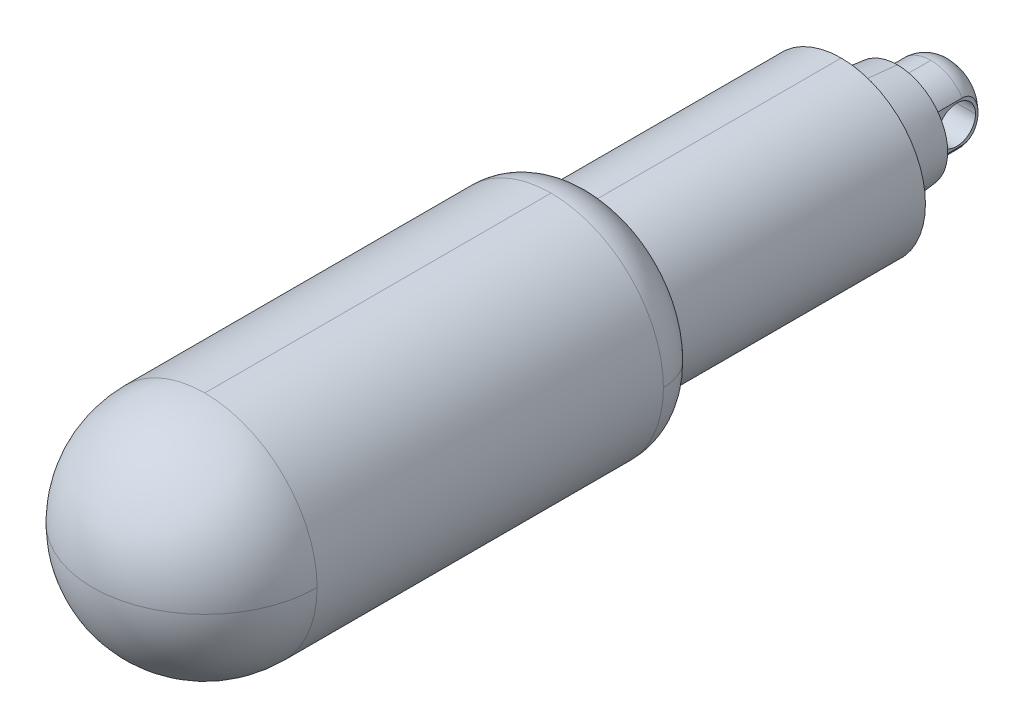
ISO-10303-21;
HEADER;
FILE_DESCRIPTION(('STEP AP214'),'2;1');
FILE_NAME('part.step','',(''),(''),'','','');
FILE_SCHEMA(('AUTOMOTIVE_DESIGN { 1 0 10303 214 1 1 1 1 }'));
ENDSEC;
DATA;
#1=APPLICATION_CONTEXT('core data for automotive mechanical design processes');
#2=APPLICATION_PROTOCOL_DEFINITION('international standard','automotive_design',2000,#1);
#3=PRODUCT_CONTEXT('',#1,'mechanical');
#4=PRODUCT('Part','Part','',(#3));
#5=PRODUCT_RELATED_PRODUCT_CATEGORY('part','',(#4));
#6=PRODUCT_DEFINITION_FORMATION('','',#4);
#7=PRODUCT_DEFINITION_CONTEXT('part definition',#1,'design');
#8=PRODUCT_DEFINITION('design','',#6,#7);
#9=PRODUCT_DEFINITION_SHAPE('','',#8);
#10=(LENGTH_UNIT() NAMED_UNIT(*) SI_UNIT(.MILLI.,.METRE.));
#11=(NAMED_UNIT(*) PLANE_ANGLE_UNIT() SI_UNIT($,.RADIAN.));
#12=(NAMED_UNIT(*) SI_UNIT($,.STERADIAN.) SOLID_ANGLE_UNIT());
#13=UNCERTAINTY_MEASURE_WITH_UNIT(LENGTH_MEASURE(1.E-05),#10,'distance_accuracy_value','');
#14=(GEOMETRIC_REPRESENTATION_CONTEXT(3) GLOBAL_UNCERTAINTY_ASSIGNED_CONTEXT((#13)) GLOBAL_UNIT_ASSIGNED_CONTEXT((#10,
#11,#12)) REPRESENTATION_CONTEXT('',''));
#15=CARTESIAN_POINT('',(0.,0.,0.));
#16=DIRECTION('',(0.,0.,1.));
#17=DIRECTION('',(1.,0.,0.));
#18=AXIS2_PLACEMENT_3D('',#15,#16,#17);
#19=CARTESIAN_POINT('',(0.,-0.75,-3.0833333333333));
#20=DIRECTION('',(0.,0.,-1.));
#21=DIRECTION('',(0.,-1.,0.));
#22=AXIS2_PLACEMENT_3D('',#19,#20,#21);
#23=PLANE('',#22);
#24=CARTESIAN_POINT('',(0.,0.,-3.0833333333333));
#25=DIRECTION('',(0.,0.,1.));
#26=DIRECTION('',(-1.,0.,0.));
#27=AXIS2_PLACEMENT_3D('',#24,#25,#26);
#28=CIRCLE('',#27,1.5);
#29=CARTESIAN_POINT('',(-1.5,0.,-3.0833333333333));
#30=VERTEX_POINT('',#29);
#31=CARTESIAN_POINT('',(0.,-1.5,-3.0833333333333));
#32=VERTEX_POINT('',#31);
#33=EDGE_CURVE('E134',#30,#32,#28,.T.);
#34=ORIENTED_EDGE('',*,*,#33,.F.);
#35=CARTESIAN_POINT('',(0.,0.,-3.0833333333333));
#36=DIRECTION('',(0.,0.,1.));
#37=DIRECTION('',(1.,0.,0.));
#38=AXIS2_PLACEMENT_3D('',#35,#36,#37);
#39=CIRCLE('',#38,1.5);
#40=CARTESIAN_POINT('',(1.5,0.,-3.0833333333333));
#41=VERTEX_POINT('',#40);
#42=EDGE_CURVE('E138',#41,#30,#39,.T.);
#43=ORIENTED_EDGE('',*,*,#42,.F.);
#44=CARTESIAN_POINT('',(0.,0.,-3.0833333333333));
#45=DIRECTION('',(0.,0.,1.));
#46=DIRECTION('',(0.,-1.,0.));
#47=AXIS2_PLACEMENT_3D('',#44,#45,#46);
#48=CIRCLE('',#47,1.5);
#49=EDGE_CURVE('E131',#32,#41,#48,.T.);
#50=ORIENTED_EDGE('',*,*,#49,.F.);
#51=EDGE_LOOP('',(#34,#43,#50));
#52=FACE_BOUND('',#51,.T.);
#53=ADVANCED_FACE('F14',(#52),#23,.T.);
#54=CARTESIAN_POINT('',(-12.,0.,0.));
#55=DIRECTION('',(-1.,0.,0.));
#56=DIRECTION('',(0.,-1.,0.));
#57=AXIS2_PLACEMENT_3D('',#54,#55,#56);
#58=CYLINDRICAL_SURFACE('',#57,2.);
#59=CARTESIAN_POINT('',(3.35,0.,0.));
#60=DIRECTION('',(-1.,0.,0.));
#61=DIRECTION('',(0.,-1.,0.));
#62=AXIS2_PLACEMENT_3D('',#59,#60,#61);
#63=CIRCLE('',#62,2.);
#64=CARTESIAN_POINT('',(3.35,0.,2.));
#65=VERTEX_POINT('',#64);
#66=CARTESIAN_POINT('',(3.35,0.,-2.));
#67=VERTEX_POINT('',#66);
#68=EDGE_CURVE('E201',#65,#67,#63,.F.);
#69=ORIENTED_EDGE('',*,*,#68,.T.);
#70=DIRECTION('',(-1.,0.,0.));
#71=VECTOR('',#70,1.);
#72=CARTESIAN_POINT('',(-12.,0.,-2.));
#73=LINE('',#72,#71);
#74=CARTESIAN_POINT('',(-3.35,0.,-2.));
#75=VERTEX_POINT('',#74);
#76=EDGE_CURVE('E112',#67,#75,#73,.T.);
#77=ORIENTED_EDGE('',*,*,#76,.T.);
#78=CARTESIAN_POINT('',(-3.35,0.,0.));
#79=DIRECTION('',(-1.,0.,0.));
#80=DIRECTION('',(0.,-1.,0.));
#81=AXIS2_PLACEMENT_3D('',#78,#79,#80);
#82=CIRCLE('',#81,2.);
#83=CARTESIAN_POINT('',(-3.35,0.,2.));
#84=VERTEX_POINT('',#83);
#85=EDGE_CURVE('E213',#75,#84,#82,.T.);
#86=ORIENTED_EDGE('',*,*,#85,.T.);
#87=DIRECTION('',(-1.,0.,0.));
#88=VECTOR('',#87,1.);
#89=CARTESIAN_POINT('',(-12.,0.,2.));
#90=LINE('',#89,#88);
#91=EDGE_CURVE('E150',#84,#65,#90,.F.);
#92=ORIENTED_EDGE('',*,*,#91,.T.);
#93=EDGE_LOOP('',(#69,#77,#86,#92));
#94=FACE_BOUND('',#93,.T.);
#95=ADVANCED_FACE('F411',(#94),#58,.F.);
#96=CARTESIAN_POINT('',(-12.,0.,0.));
#97=DIRECTION('',(-1.,0.,0.));
#98=DIRECTION('',(0.,-1.,0.));
#99=AXIS2_PLACEMENT_3D('',#96,#97,#98);
#100=CYLINDRICAL_SURFACE('',#99,2.);
#101=CARTESIAN_POINT('',(-3.35,0.,0.));
#102=DIRECTION('',(-1.,0.,0.));
#103=DIRECTION('',(0.,-1.,0.));
#104=AXIS2_PLACEMENT_3D('',#101,#102,#103);
#105=CIRCLE('',#104,2.);
#106=EDGE_CURVE('E318',#84,#75,#105,.T.);
#107=ORIENTED_EDGE('',*,*,#106,.T.);
#108=ORIENTED_EDGE('',*,*,#76,.F.);
#109=CARTESIAN_POINT('',(3.35,0.,0.));
#110=DIRECTION('',(-1.,0.,0.));
#111=DIRECTION('',(0.,-1.,0.));
#112=AXIS2_PLACEMENT_3D('',#109,#110,#111);
#113=CIRCLE('',#112,2.);
#114=EDGE_CURVE('E18',#67,#65,#113,.F.);
#115=ORIENTED_EDGE('',*,*,#114,.T.);
#116=ORIENTED_EDGE('',*,*,#91,.F.);
#117=EDGE_LOOP('',(#107,#108,#115,#116));
#118=FACE_BOUND('',#117,.T.);
#119=ADVANCED_FACE('F171',(#118),#100,.F.);
#120=CARTESIAN_POINT('',(1.5,0.,-0.583333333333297));
#121=DIRECTION('',(0.,1.,0.));
#122=DIRECTION('',(1.,0.,0.));
#123=AXIS2_PLACEMENT_3D('',#120,#121,#122);
#124=CIRCLE('',#123,2.5);
#125=TRIMMED_CURVE('',#124,(PARAMETER_VALUE(-2.21429743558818)),
(PARAMETER_VALUE(2.21429743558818)),.T.,.PARAMETER.);
#126=CARTESIAN_POINT('',(0.,0.,-0.583333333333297));
#127=DIRECTION('',(0.,0.,1.));
#128=AXIS1_PLACEMENT('',#126,#127);
#129=SURFACE_OF_REVOLUTION('',#125,#128);
#130=ORIENTED_EDGE('',*,*,#33,.T.);
#131=ORIENTED_EDGE('',*,*,#49,.T.);
#132=CARTESIAN_POINT('',(1.5,0.,-0.583333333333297));
#133=DIRECTION('',(0.,1.,0.));
#134=DIRECTION('',(1.,0.,0.));
#135=AXIS2_PLACEMENT_3D('',#132,#133,#134);
#136=CIRCLE('',#135,2.5);
#137=CARTESIAN_POINT('',(3.35,0.,-2.2648505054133));
#138=VERTEX_POINT('',#137);
#139=EDGE_CURVE('E143',#138,#41,#136,.T.);
#140=ORIENTED_EDGE('',*,*,#139,.F.);
#141=CARTESIAN_POINT('',(3.35,0.,-2.2648505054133));
#142=CARTESIAN_POINT('',(3.35,-0.0754425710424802,-2.26483182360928));
#143=CARTESIAN_POINT('',(3.35,-0.15089491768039,-2.26204566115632));
#144=CARTESIAN_POINT('',(3.35,-0.301463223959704,-2.25079679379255));
#145=CARTESIAN_POINT('',(3.35,-0.376578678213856,-2.24232735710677));
#146=CARTESIAN_POINT('',(3.35,-0.52665281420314,-2.21946055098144));
#147=CARTESIAN_POINT('',(3.35,-0.601603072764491,-2.20500707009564));
#148=CARTESIAN_POINT('',(3.35,-0.750000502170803,-2.16992943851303));
#149=CARTESIAN_POINT('',(3.35,-0.823448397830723,-2.14930834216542));
#150=CARTESIAN_POINT('',(3.35,-1.00988032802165,-2.08785206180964));
#151=CARTESIAN_POINT('',(3.35000000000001,-1.12134084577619,-2.04220953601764));
#152=CARTESIAN_POINT('',(3.34999999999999,-1.33522725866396,-1.93376510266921));
#153=CARTESIAN_POINT('',(3.34999999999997,-1.43768585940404,-1.87102902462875));
#154=CARTESIAN_POINT('',(3.35000000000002,-1.60964311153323,-1.74246365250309));
#155=CARTESIAN_POINT('',(3.35000000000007,-1.68158732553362,-1.6799220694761));
#156=CARTESIAN_POINT('',(3.34999999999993,-1.81436566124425,-1.54384878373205));
#157=CARTESIAN_POINT('',(3.34999999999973,-1.87519707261,-1.47031440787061));
#158=CARTESIAN_POINT('',(3.3499999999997,-1.98313209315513,-1.31268560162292));
#159=CARTESIAN_POINT('',(3.34999999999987,-2.03011755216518,-1.2285085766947));
#160=CARTESIAN_POINT('',(3.35000000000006,-2.08749421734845,-1.09673181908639));
#161=CARTESIAN_POINT('',(3.35000000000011,-2.10443360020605,-1.05189952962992));
#162=CARTESIAN_POINT('',(3.34999999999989,-2.13369721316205,-0.960761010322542));
#163=CARTESIAN_POINT('',(3.34999999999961,-2.14602396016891,-0.914455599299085));
#164=CARTESIAN_POINT('',(3.34999999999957,-2.16580487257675,-0.820926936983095));
#165=CARTESIAN_POINT('',(3.34999999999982,-2.17327015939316,-0.773706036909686));
#166=CARTESIAN_POINT('',(3.35000000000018,-2.18324910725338,-0.678770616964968));
#167=CARTESIAN_POINT('',(3.35000000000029,-2.18576541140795,-0.631056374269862));
#168=CARTESIAN_POINT('',(3.35,-2.18574929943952,-0.583333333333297));
#169=B_SPLINE_CURVE_WITH_KNOTS('',3,(#141,#142,#143,#144,#145,#146,#147,#148,#149,#150,#151,
#152,#153,#154,#155,#156,#157,#158,#159,#160,#161,#162,#163,#164,#165,#166,#167,#168),
.UNSPECIFIED.,.F.,.F.,(4,2,2,2,2,2,2,2,2,2,2,2,2,4),(0.,0.226291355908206,0.452851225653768,
0.681585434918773,0.910206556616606,1.27014773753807,1.62872186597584,1.91357555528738,
2.19849862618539,2.48578692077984,2.62935968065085,2.77285398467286,2.91601885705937,
3.05910724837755),.UNSPECIFIED.);
#170=CARTESIAN_POINT('',(3.35,-2.18574929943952,-0.583333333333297));
#171=VERTEX_POINT('',#170);
#172=EDGE_CURVE('E312',#138,#171,#169,.T.);
#173=ORIENTED_EDGE('',*,*,#172,.T.);
#174=CARTESIAN_POINT('',(0.,0.,-0.583333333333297));
#175=DIRECTION('',(0.,0.,-1.));
#176=DIRECTION('',(1.,0.,0.));
#177=AXIS2_PLACEMENT_3D('',#174,#175,#176);
#178=CIRCLE('',#177,4.);
#179=CARTESIAN_POINT('',(0.,-4.,-0.583333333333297));
#180=VERTEX_POINT('',#179);
#181=EDGE_CURVE('E195',#180,#171,#178,.F.);
#182=ORIENTED_EDGE('',*,*,#181,.F.);
#183=CARTESIAN_POINT('',(0.,0.,-0.583333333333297));
#184=DIRECTION('',(0.,0.,-1.));
#185=DIRECTION('',(1.,0.,0.));
#186=AXIS2_PLACEMENT_3D('',#183,#184,#185);
#187=CIRCLE('',#186,4.);
#188=CARTESIAN_POINT('',(-3.35,-2.18574929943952,-0.583333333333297));
#189=VERTEX_POINT('',#188);
#190=EDGE_CURVE('E119',#189,#180,#187,.F.);
#191=ORIENTED_EDGE('',*,*,#190,.F.);
#192=CARTESIAN_POINT('',(-3.35,-2.18574929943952,-0.583333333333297));
#193=CARTESIAN_POINT('',(-3.35,-2.18576028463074,-0.626622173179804));
#194=CARTESIAN_POINT('',(-3.35,-2.18369202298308,-0.669905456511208));
#195=CARTESIAN_POINT('',(-3.35,-2.17548130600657,-0.75606406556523));
#196=CARTESIAN_POINT('',(-3.35,-2.16934076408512,-0.798939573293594));
#197=CARTESIAN_POINT('',(-3.35,-2.15311794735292,-0.883674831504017));
#198=CARTESIAN_POINT('',(-3.35,-2.14305929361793,-0.92553910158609));
#199=CARTESIAN_POINT('',(-3.35,-2.11916399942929,-1.00816362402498));
#200=CARTESIAN_POINT('',(-3.35,-2.10532713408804,-1.04892381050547));
#201=CARTESIAN_POINT('',(-3.35,-2.05847222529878,-1.16896268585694));
#202=CARTESIAN_POINT('',(-3.35,-2.02006977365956,-1.24620337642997));
#203=CARTESIAN_POINT('',(-3.35,-1.93091834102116,-1.39316793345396));
#204=CARTESIAN_POINT('',(-3.35,-1.88015621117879,-1.46288367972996));
#205=CARTESIAN_POINT('',(-3.35,-1.76840219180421,-1.59379734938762));
#206=CARTESIAN_POINT('',(-3.35,-1.70738594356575,-1.6549743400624));
#207=CARTESIAN_POINT('',(-3.35,-1.57742304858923,-1.76811368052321));
#208=CARTESIAN_POINT('',(-3.35,-1.50847575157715,-1.82007527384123));
#209=CARTESIAN_POINT('',(-3.35,-1.32954562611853,-1.93786242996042));
#210=CARTESIAN_POINT('',(-3.35,-1.21590781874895,-1.99814822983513));
#211=CARTESIAN_POINT('',(-3.35,-0.980125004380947,-2.09968218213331));
#212=CARTESIAN_POINT('',(-3.34999999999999,-0.857950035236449,-2.14085896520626));
#213=CARTESIAN_POINT('',(-3.35,-0.673529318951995,-2.1887320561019));
#214=CARTESIAN_POINT('',(-3.35000000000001,-0.612952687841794,-2.20224909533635));
#215=CARTESIAN_POINT('',(-3.34999999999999,-0.491029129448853,-2.2252901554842));
#216=CARTESIAN_POINT('',(-3.34999999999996,-0.429682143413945,-2.2348138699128));
#217=CARTESIAN_POINT('',(-3.35000000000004,-0.307044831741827,-2.24991444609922));
#218=CARTESIAN_POINT('',(-3.35000000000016,-0.245758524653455,-2.25552442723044));
#219=CARTESIAN_POINT('',(-3.34999999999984,-0.122980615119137,-2.26298753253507));
#220=CARTESIAN_POINT('',(-3.34999999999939,-0.0614891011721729,-2.26484210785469));
#221=CARTESIAN_POINT('',(-3.3499999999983,0.,-2.2648505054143));
#222=B_SPLINE_CURVE_WITH_KNOTS('',3,(#192,#193,#194,#195,#196,#197,#198,#199,#200,#201,#202,
#203,#204,#205,#206,#207,#208,#209,#210,#211,#212,#213,#214,#215,#216,#217,#218,#219,#220,#221),
.UNSPECIFIED.,.F.,.F.,(4,2,2,2,2,2,2,2,2,2,2,2,2,2,4),(0.,0.129807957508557,0.259554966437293,
0.388531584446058,0.517515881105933,0.774870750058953,1.03250061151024,1.29075135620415,
1.54902329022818,1.93284731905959,2.31809356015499,2.50418781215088,2.69029634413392,
2.87481020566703,3.05925275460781),.UNSPECIFIED.);
#223=CARTESIAN_POINT('',(-3.35,0.,-2.2648505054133));
#224=VERTEX_POINT('',#223);
#225=EDGE_CURVE('E263',#189,#224,#222,.T.);
#226=ORIENTED_EDGE('',*,*,#225,.T.);
#227=CARTESIAN_POINT('',(-1.5,0.,-0.583333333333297));
#228=DIRECTION('',(0.,-1.,0.));
#229=DIRECTION('',(-1.,0.,0.));
#230=AXIS2_PLACEMENT_3D('',#227,#228,#229);
#231=CIRCLE('',#230,2.5);
#232=EDGE_CURVE('E149',#30,#224,#231,.F.);
#233=ORIENTED_EDGE('',*,*,#232,.F.);
#234=EDGE_LOOP('',(#130,#131,#140,#173,#182,#191,#226,#233));
#235=FACE_BOUND('',#234,.T.);
#236=ADVANCED_FACE('F147',(#235),#129,.F.);
#237=CARTESIAN_POINT('',(1.5,0.,-0.583333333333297));
#238=DIRECTION('',(0.,1.,0.));
#239=DIRECTION('',(1.,0.,0.));
#240=AXIS2_PLACEMENT_3D('',#237,#238,#239);
#241=CIRCLE('',#240,2.5);
#242=TRIMMED_CURVE('',#241,(PARAMETER_VALUE(-2.21429743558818)),
(PARAMETER_VALUE(2.21429743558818)),.T.,.PARAMETER.);
#243=CARTESIAN_POINT('',(0.,0.,-0.583333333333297));
#244=DIRECTION('',(0.,0.,1.));
#245=AXIS1_PLACEMENT('',#243,#244);
#246=SURFACE_OF_REVOLUTION('',#242,#245);
#247=CARTESIAN_POINT('',(0.,0.,-0.583333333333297));
#248=DIRECTION('',(0.,0.,-1.));
#249=DIRECTION('',(1.,0.,0.));
#250=AXIS2_PLACEMENT_3D('',#247,#248,#249);
#251=CIRCLE('',#250,4.);
#252=CARTESIAN_POINT('',(3.3500000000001,2.18574929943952,-0.583333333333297));
#253=VERTEX_POINT('',#252);
#254=CARTESIAN_POINT('',(0.,4.,-0.583333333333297));
#255=VERTEX_POINT('',#254);
#256=EDGE_CURVE('E188',#253,#255,#251,.F.);
#257=ORIENTED_EDGE('',*,*,#256,.F.);
#258=CARTESIAN_POINT('',(3.35,2.18574929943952,-0.583333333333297));
#259=CARTESIAN_POINT('',(3.35,2.18576028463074,-0.626622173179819));
#260=CARTESIAN_POINT('',(3.35,2.18369202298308,-0.669905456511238));
#261=CARTESIAN_POINT('',(3.35,2.17548130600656,-0.756064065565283));
#262=CARTESIAN_POINT('',(3.35,2.16934076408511,-0.798939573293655));
#263=CARTESIAN_POINT('',(3.35,2.1531179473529,-0.883674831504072));
#264=CARTESIAN_POINT('',(3.35,2.14305929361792,-0.925539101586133));
#265=CARTESIAN_POINT('',(3.35,2.11916399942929,-1.008163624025));
#266=CARTESIAN_POINT('',(3.35,2.10532713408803,-1.04892381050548));
#267=CARTESIAN_POINT('',(3.35,2.05847222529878,-1.16896268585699));
#268=CARTESIAN_POINT('',(3.35,2.0200697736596,-1.24620337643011));
#269=CARTESIAN_POINT('',(3.35,1.93091834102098,-1.39316793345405));
#270=CARTESIAN_POINT('',(3.35,1.88015621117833,-1.46288367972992));
#271=CARTESIAN_POINT('',(3.35,1.7684021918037,-1.59379734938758));
#272=CARTESIAN_POINT('',(3.35,1.70738594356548,-1.65497434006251));
#273=CARTESIAN_POINT('',(3.35,1.57742304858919,-1.76811368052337));
#274=CARTESIAN_POINT('',(3.35,1.50847575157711,-1.8200752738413));
#275=CARTESIAN_POINT('',(3.35,1.3295456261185,-1.93786242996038));
#276=CARTESIAN_POINT('',(3.35,1.21590781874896,-1.99814822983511));
#277=CARTESIAN_POINT('',(3.35,0.980125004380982,-2.09968218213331));
#278=CARTESIAN_POINT('',(3.34999999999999,0.857950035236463,-2.14085896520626));
#279=CARTESIAN_POINT('',(3.35,0.673529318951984,-2.1887320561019));
#280=CARTESIAN_POINT('',(3.35000000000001,0.612952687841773,-2.20224909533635));
#281=CARTESIAN_POINT('',(3.34999999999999,0.491029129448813,-2.22529015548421));
#282=CARTESIAN_POINT('',(3.34999999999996,0.429682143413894,-2.23481386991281));
#283=CARTESIAN_POINT('',(3.35000000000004,0.307044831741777,-2.24991444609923));
#284=CARTESIAN_POINT('',(3.35000000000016,0.245758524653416,-2.25552442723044));
#285=CARTESIAN_POINT('',(3.34999999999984,0.122980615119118,-2.26298753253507));
#286=CARTESIAN_POINT('',(3.34999999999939,0.0614891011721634,-2.26484210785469));
#287=CARTESIAN_POINT('',(3.3499999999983,0.,-2.2648505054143));
#288=B_SPLINE_CURVE_WITH_KNOTS('',3,(#258,#259,#260,#261,#262,#263,#264,#265,#266,#267,#268,
#269,#270,#271,#272,#273,#274,#275,#276,#277,#278,#279,#280,#281,#282,#283,#284,#285,#286,#287),
.UNSPECIFIED.,.F.,.F.,(4,2,2,2,2,2,2,2,2,2,2,2,2,2,4),(0.,0.129807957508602,0.259554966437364,
0.388531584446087,0.517515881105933,0.774870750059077,1.03250061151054,1.2907513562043,
1.54902329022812,1.93284731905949,2.31809356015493,2.50418781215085,2.69029634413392,
2.874810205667,3.05925275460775),.UNSPECIFIED.);
#289=EDGE_CURVE('E306',#253,#138,#288,.T.);
#290=ORIENTED_EDGE('',*,*,#289,.T.);
#291=ORIENTED_EDGE('',*,*,#139,.T.);
#292=ORIENTED_EDGE('',*,*,#42,.T.);
#293=ORIENTED_EDGE('',*,*,#232,.T.);
#294=CARTESIAN_POINT('',(-3.35,0.,-2.2648505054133));
#295=CARTESIAN_POINT('',(-3.35,0.0754425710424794,-2.26483182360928));
#296=CARTESIAN_POINT('',(-3.35,0.150894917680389,-2.26204566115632));
#297=CARTESIAN_POINT('',(-3.35,0.301463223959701,-2.25079679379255));
#298=CARTESIAN_POINT('',(-3.35,0.376578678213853,-2.24232735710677));
#299=CARTESIAN_POINT('',(-3.35,0.526652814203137,-2.21946055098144));
#300=CARTESIAN_POINT('',(-3.35,0.601603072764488,-2.20500707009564));
#301=CARTESIAN_POINT('',(-3.35,0.750000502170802,-2.16992943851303));
#302=CARTESIAN_POINT('',(-3.35,0.823448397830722,-2.14930834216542));
#303=CARTESIAN_POINT('',(-3.35,1.00988032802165,-2.08785206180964));
#304=CARTESIAN_POINT('',(-3.35000000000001,1.12134084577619,-2.04220953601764));
#305=CARTESIAN_POINT('',(-3.34999999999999,1.33522725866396,-1.9337651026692));
#306=CARTESIAN_POINT('',(-3.34999999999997,1.43768585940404,-1.87102902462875));
#307=CARTESIAN_POINT('',(-3.35000000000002,1.60964311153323,-1.74246365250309));
#308=CARTESIAN_POINT('',(-3.35000000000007,1.68158732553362,-1.6799220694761));
#309=CARTESIAN_POINT('',(-3.34999999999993,1.81436566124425,-1.54384878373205));
#310=CARTESIAN_POINT('',(-3.34999999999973,1.87519707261,-1.47031440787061));
#311=CARTESIAN_POINT('',(-3.34999999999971,1.98313209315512,-1.31268560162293));
#312=CARTESIAN_POINT('',(-3.34999999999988,2.03011755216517,-1.22850857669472));
#313=CARTESIAN_POINT('',(-3.35000000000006,2.08749421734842,-1.09673181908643));
#314=CARTESIAN_POINT('',(-3.35000000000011,2.10443360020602,-1.05189952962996));
#315=CARTESIAN_POINT('',(-3.34999999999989,2.13369721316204,-0.960761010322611));
#316=CARTESIAN_POINT('',(-3.34999999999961,2.14602396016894,-0.914455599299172));
#317=CARTESIAN_POINT('',(-3.34999999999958,2.16580487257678,-0.82092693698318));
#318=CARTESIAN_POINT('',(-3.34999999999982,2.17327015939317,-0.773706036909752));
#319=CARTESIAN_POINT('',(-3.35000000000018,2.18324910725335,-0.678770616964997));
#320=CARTESIAN_POINT('',(-3.35000000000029,2.18576541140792,-0.631056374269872));
#321=CARTESIAN_POINT('',(-3.35,2.18574929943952,-0.583333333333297));
#322=B_SPLINE_CURVE_WITH_KNOTS('',3,(#294,#295,#296,#297,#298,#299,#300,#301,#302,#303,#304,
#305,#306,#307,#308,#309,#310,#311,#312,#313,#314,#315,#316,#317,#318,#319,#320,#321),
.UNSPECIFIED.,.F.,.F.,(4,2,2,2,2,2,2,2,2,2,2,2,2,4),(0.,0.226291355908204,0.452851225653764,
0.681585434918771,0.910206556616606,1.27014773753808,1.62872186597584,1.91357555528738,
2.19849862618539,2.4857869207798,2.62935968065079,2.77285398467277,2.91601885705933,
3.05910724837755),.UNSPECIFIED.);
#323=CARTESIAN_POINT('',(-3.35,2.18574929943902,-0.583333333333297));
#324=VERTEX_POINT('',#323);
#325=EDGE_CURVE('E256',#224,#324,#322,.T.);
#326=ORIENTED_EDGE('',*,*,#325,.T.);
#327=CARTESIAN_POINT('',(0.,0.,-0.583333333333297));
#328=DIRECTION('',(0.,0.,-1.));
#329=DIRECTION('',(1.,0.,0.));
#330=AXIS2_PLACEMENT_3D('',#327,#328,#329);
#331=CIRCLE('',#330,4.);
#332=EDGE_CURVE('E210',#255,#324,#331,.F.);
#333=ORIENTED_EDGE('',*,*,#332,.F.);
#334=EDGE_LOOP('',(#257,#290,#291,#292,#293,#326,#333));
#335=FACE_BOUND('',#334,.T.);
#336=ADVANCED_FACE('F170',(#335),#246,.F.);
#337=CARTESIAN_POINT('',(0.,0.,1.2083333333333));
#338=DIRECTION('',(0.,0.,-1.));
#339=DIRECTION('',(1.,0.,0.));
#340=AXIS2_PLACEMENT_3D('',#337,#338,#339);
#341=CYLINDRICAL_SURFACE('',#340,4.);
#342=DIRECTION('',(0.,0.,1.));
#343=VECTOR('',#342,1.);
#344=CARTESIAN_POINT('',(-3.35,-2.18574929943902,3.));
#345=LINE('',#344,#343);
#346=CARTESIAN_POINT('',(-3.35,-2.18574929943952,3.));
#347=VERTEX_POINT('',#346);
#348=EDGE_CURVE('E269',#347,#189,#345,.F.);
#349=ORIENTED_EDGE('',*,*,#348,.T.);
#350=ORIENTED_EDGE('',*,*,#190,.T.);
#351=DIRECTION('',(0.,0.,-1.));
#352=VECTOR('',#351,1.);
#353=CARTESIAN_POINT('',(0.,-4.,1.2083333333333));
#354=LINE('',#353,#352);
#355=CARTESIAN_POINT('',(0.,-4.,3.));
#356=VERTEX_POINT('',#355);
#357=EDGE_CURVE('E183',#356,#180,#354,.T.);
#358=ORIENTED_EDGE('',*,*,#357,.F.);
#359=CARTESIAN_POINT('',(0.,0.,3.));
#360=DIRECTION('',(0.,0.,-1.));
#361=DIRECTION('',(1.,0.,0.));
#362=AXIS2_PLACEMENT_3D('',#359,#360,#361);
#363=CIRCLE('',#362,4.);
#364=EDGE_CURVE('E267',#347,#356,#363,.F.);
#365=ORIENTED_EDGE('',*,*,#364,.F.);
#366=EDGE_LOOP('',(#349,#350,#358,#365));
#367=FACE_BOUND('',#366,.T.);
#368=ADVANCED_FACE('F660',(#367),#341,.T.);
#369=CARTESIAN_POINT('',(0.,0.,1.2083333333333));
#370=DIRECTION('',(0.,0.,-1.));
#371=DIRECTION('',(1.,0.,0.));
#372=AXIS2_PLACEMENT_3D('',#369,#370,#371);
#373=CYLINDRICAL_SURFACE('',#372,4.);
#374=DIRECTION('',(0.,0.,-1.));
#375=VECTOR('',#374,1.);
#376=CARTESIAN_POINT('',(3.35,-2.18574929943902,-2.5833333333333));
#377=LINE('',#376,#375);
#378=CARTESIAN_POINT('',(3.35,-2.18574929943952,3.));
#379=VERTEX_POINT('',#378);
#380=EDGE_CURVE('E206',#171,#379,#377,.F.);
#381=ORIENTED_EDGE('',*,*,#380,.T.);
#382=CARTESIAN_POINT('',(0.,0.,3.));
#383=DIRECTION('',(0.,0.,-1.));
#384=DIRECTION('',(1.,0.,0.));
#385=AXIS2_PLACEMENT_3D('',#382,#383,#384);
#386=CIRCLE('',#385,4.);
#387=EDGE_CURVE('E332',#356,#379,#386,.F.);
#388=ORIENTED_EDGE('',*,*,#387,.F.);
#389=ORIENTED_EDGE('',*,*,#357,.T.);
#390=ORIENTED_EDGE('',*,*,#181,.T.);
#391=EDGE_LOOP('',(#381,#388,#389,#390));
#392=FACE_BOUND('',#391,.T.);
#393=ADVANCED_FACE('F302',(#392),#373,.T.);
#394=CARTESIAN_POINT('',(3.35,12.,-2.5833333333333));
#395=DIRECTION('',(-1.,0.,0.));
#396=DIRECTION('',(0.,0.,-1.));
#397=AXIS2_PLACEMENT_3D('',#394,#395,#396);
#398=PLANE('',#397);
#399=ORIENTED_EDGE('',*,*,#172,.F.);
#400=ORIENTED_EDGE('',*,*,#289,.F.);
#401=DIRECTION('',(0.,0.,-1.));
#402=VECTOR('',#401,1.);
#403=CARTESIAN_POINT('',(3.35000000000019,2.18574929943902,1.2083333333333));
#404=LINE('',#403,#402);
#405=CARTESIAN_POINT('',(3.3500000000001,2.18574929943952,3.));
#406=VERTEX_POINT('',#405);
#407=EDGE_CURVE('E192',#406,#253,#404,.T.);
#408=ORIENTED_EDGE('',*,*,#407,.F.);
#409=DIRECTION('',(0.,-1.,0.));
#410=VECTOR('',#409,1.);
#411=CARTESIAN_POINT('',(3.35,-4.68468729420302,3.));
#412=LINE('',#411,#410);
#413=EDGE_CURVE('E336',#379,#406,#412,.F.);
#414=ORIENTED_EDGE('',*,*,#413,.F.);
#415=ORIENTED_EDGE('',*,*,#380,.F.);
#416=EDGE_LOOP('',(#399,#400,#408,#414,#415));
#417=FACE_BOUND('',#416,.T.);
#418=ORIENTED_EDGE('',*,*,#114,.F.);
#419=ORIENTED_EDGE('',*,*,#68,.F.);
#420=EDGE_LOOP('',(#418,#419));
#421=FACE_BOUND('',#420,.T.);
#422=ADVANCED_FACE('F297',(#417,#421),#398,.F.);
#423=CARTESIAN_POINT('',(0.,0.,1.2083333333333));
#424=DIRECTION('',(0.,0.,-1.));
#425=DIRECTION('',(1.,0.,0.));
#426=AXIS2_PLACEMENT_3D('',#423,#424,#425);
#427=CYLINDRICAL_SURFACE('',#426,4.);
#428=ORIENTED_EDGE('',*,*,#407,.T.);
#429=ORIENTED_EDGE('',*,*,#256,.T.);
#430=DIRECTION('',(0.,0.,-1.));
#431=VECTOR('',#430,1.);
#432=CARTESIAN_POINT('',(0.,4.,1.2083333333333));
#433=LINE('',#432,#431);
#434=CARTESIAN_POINT('',(0.,4.,3.));
#435=VERTEX_POINT('',#434);
#436=EDGE_CURVE('E191',#435,#255,#433,.T.);
#437=ORIENTED_EDGE('',*,*,#436,.F.);
#438=CARTESIAN_POINT('',(0.,0.,3.));
#439=DIRECTION('',(0.,0.,-1.));
#440=DIRECTION('',(1.,0.,0.));
#441=AXIS2_PLACEMENT_3D('',#438,#439,#440);
#442=CIRCLE('',#441,4.);
#443=EDGE_CURVE('E340',#406,#435,#442,.F.);
#444=ORIENTED_EDGE('',*,*,#443,.F.);
#445=EDGE_LOOP('',(#428,#429,#437,#444));
#446=FACE_BOUND('',#445,.T.);
#447=ADVANCED_FACE('F293',(#446),#427,.T.);
#448=CARTESIAN_POINT('',(0.,0.,1.2083333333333));
#449=DIRECTION('',(0.,0.,-1.));
#450=DIRECTION('',(1.,0.,0.));
#451=AXIS2_PLACEMENT_3D('',#448,#449,#450);
#452=CYLINDRICAL_SURFACE('',#451,4.);
#453=DIRECTION('',(0.,0.,1.));
#454=VECTOR('',#453,1.);
#455=CARTESIAN_POINT('',(-3.35,2.18574929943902,3.));
#456=LINE('',#455,#454);
#457=CARTESIAN_POINT('',(-3.35,2.18574929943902,3.));
#458=VERTEX_POINT('',#457);
#459=EDGE_CURVE('E265',#324,#458,#456,.T.);
#460=ORIENTED_EDGE('',*,*,#459,.T.);
#461=CARTESIAN_POINT('',(0.,0.,3.));
#462=DIRECTION('',(0.,0.,-1.));
#463=DIRECTION('',(1.,0.,0.));
#464=AXIS2_PLACEMENT_3D('',#461,#462,#463);
#465=CIRCLE('',#464,4.);
#466=EDGE_CURVE('E346',#435,#458,#465,.F.);
#467=ORIENTED_EDGE('',*,*,#466,.F.);
#468=ORIENTED_EDGE('',*,*,#436,.T.);
#469=ORIENTED_EDGE('',*,*,#332,.T.);
#470=EDGE_LOOP('',(#460,#467,#468,#469));
#471=FACE_BOUND('',#470,.T.);
#472=ADVANCED_FACE('F288',(#471),#452,.T.);
#473=CARTESIAN_POINT('',(-3.35,12.,3.));
#474=DIRECTION('',(1.,0.,0.));
#475=DIRECTION('',(0.,0.,1.));
#476=AXIS2_PLACEMENT_3D('',#473,#474,#475);
#477=PLANE('',#476);
#478=ORIENTED_EDGE('',*,*,#325,.F.);
#479=ORIENTED_EDGE('',*,*,#225,.F.);
#480=ORIENTED_EDGE('',*,*,#348,.F.);
#481=DIRECTION('',(0.,-1.,0.));
#482=VECTOR('',#481,1.);
#483=CARTESIAN_POINT('',(-3.35,-4.68468729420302,3.));
#484=LINE('',#483,#482);
#485=EDGE_CURVE('E348',#458,#347,#484,.T.);
#486=ORIENTED_EDGE('',*,*,#485,.F.);
#487=ORIENTED_EDGE('',*,*,#459,.F.);
#488=EDGE_LOOP('',(#478,#479,#480,#486,#487));
#489=FACE_BOUND('',#488,.T.);
#490=ORIENTED_EDGE('',*,*,#85,.F.);
#491=ORIENTED_EDGE('',*,*,#106,.F.);
#492=EDGE_LOOP('',(#490,#491));
#493=FACE_BOUND('',#492,.T.);
#494=ADVANCED_FACE('F260',(#489,#493),#477,.F.);
#495=CARTESIAN_POINT('',(0.,-4.68468729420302,3.));
#496=DIRECTION('',(0.,0.,-1.));
#497=DIRECTION('',(0.,-1.,0.));
#498=AXIS2_PLACEMENT_3D('',#495,#496,#497);
#499=PLANE('',#498);
#500=ORIENTED_EDGE('',*,*,#466,.T.);
#501=ORIENTED_EDGE('',*,*,#485,.T.);
#502=ORIENTED_EDGE('',*,*,#364,.T.);
#503=ORIENTED_EDGE('',*,*,#387,.T.);
#504=ORIENTED_EDGE('',*,*,#413,.T.);
#505=ORIENTED_EDGE('',*,*,#443,.T.);
#506=EDGE_LOOP('',(#500,#501,#502,#503,#504,#505));
#507=FACE_BOUND('',#506,.T.);
#508=CARTESIAN_POINT('',(0.,0.,3.0000000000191));
#509=DIRECTION('',(0.,0.,1.));
#510=DIRECTION('',(-1.,0.,0.));
#511=AXIS2_PLACEMENT_3D('',#508,#509,#510);
#512=CIRCLE('',#511,5.36937458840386);
#513=CARTESIAN_POINT('',(0.,5.369374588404,3.0000000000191));
#514=VERTEX_POINT('',#513);
#515=CARTESIAN_POINT('',(-3.34999999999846,-4.19615103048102,3.0000000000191));
#516=VERTEX_POINT('',#515);
#517=EDGE_CURVE('E352',#514,#516,#512,.T.);
#518=ORIENTED_EDGE('',*,*,#517,.F.);
#519=CARTESIAN_POINT('',(0.,0.,3.0000000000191));
#520=DIRECTION('',(0.,0.,1.));
#521=DIRECTION('',(-1.,0.,0.));
#522=AXIS2_PLACEMENT_3D('',#519,#520,#521);
#523=CIRCLE('',#522,5.36937458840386);
#524=CARTESIAN_POINT('',(0.,-5.3693745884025,3.0000000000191));
#525=VERTEX_POINT('',#524);
#526=EDGE_CURVE('E349',#525,#514,#523,.T.);
#527=ORIENTED_EDGE('',*,*,#526,.F.);
#528=CARTESIAN_POINT('',(0.,0.,3.0000000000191));
#529=DIRECTION('',(0.,0.,1.));
#530=DIRECTION('',(-1.,0.,0.));
#531=AXIS2_PLACEMENT_3D('',#528,#529,#530);
#532=CIRCLE('',#531,5.36937458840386);
#533=EDGE_CURVE('E355',#516,#525,#532,.T.);
#534=ORIENTED_EDGE('',*,*,#533,.F.);
#535=EDGE_LOOP('',(#518,#527,#534));
#536=FACE_BOUND('',#535,.T.);
#537=ADVANCED_FACE('F287',(#507,#536),#499,.T.);
#538=CARTESIAN_POINT('',(0.,0.,8.9999999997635));
#539=DIRECTION('',(0.,0.,1.));
#540=DIRECTION('',(-1.,0.,0.));
#541=AXIS2_PLACEMENT_3D('',#538,#539,#540);
#542=CONICAL_SURFACE('',#541,5.99999999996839,0.10471975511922);
#543=DIRECTION('',(0.,-0.104528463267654,-0.994521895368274));
#544=VECTOR('',#543,1.);
#545=CARTESIAN_POINT('',(-6.42228407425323E-12,52445.3933405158,498936.5));
#546=LINE('',#545,#544);
#547=CARTESIAN_POINT('',(0.,5.99999999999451,8.9999999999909));
#548=VERTEX_POINT('',#547);
#549=EDGE_CURVE('E356',#548,#514,#546,.T.);
#550=ORIENTED_EDGE('',*,*,#549,.F.);
#551=CARTESIAN_POINT('',(0.,0.,8.9999999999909));
#552=DIRECTION('',(0.,0.,1.));
#553=DIRECTION('',(-1.,0.,0.));
#554=AXIS2_PLACEMENT_3D('',#551,#552,#553);
#555=CIRCLE('',#554,5.99999999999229);
#556=CARTESIAN_POINT('',(0.,-5.99999999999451,8.9999999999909));
#557=VERTEX_POINT('',#556);
#558=EDGE_CURVE('E359',#557,#548,#555,.T.);
#559=ORIENTED_EDGE('',*,*,#558,.F.);
#560=DIRECTION('',(0.,0.104528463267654,-0.994521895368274));
#561=VECTOR('',#560,1.);
#562=CARTESIAN_POINT('',(1.28449923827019E-11,-52445.3933405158,498936.5));
#563=LINE('',#562,#561);
#564=EDGE_CURVE('E351',#525,#557,#563,.F.);
#565=ORIENTED_EDGE('',*,*,#564,.F.);
#566=ORIENTED_EDGE('',*,*,#526,.T.);
#567=EDGE_LOOP('',(#550,#559,#565,#566));
#568=FACE_BOUND('',#567,.T.);
#569=ADVANCED_FACE('F617',(#568),#542,.T.);
#570=CARTESIAN_POINT('',(0.,0.,8.9999999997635));
#571=DIRECTION('',(0.,0.,1.));
#572=DIRECTION('',(-1.,0.,0.));
#573=AXIS2_PLACEMENT_3D('',#570,#571,#572);
#574=CONICAL_SURFACE('',#573,5.99999999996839,0.10471975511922);
#575=ORIENTED_EDGE('',*,*,#517,.T.);
#576=ORIENTED_EDGE('',*,*,#533,.T.);
#577=ORIENTED_EDGE('',*,*,#564,.T.);
#578=CARTESIAN_POINT('',(0.,0.,8.9999999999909));
#579=DIRECTION('',(0.,0.,1.));
#580=DIRECTION('',(-1.,0.,0.));
#581=AXIS2_PLACEMENT_3D('',#578,#579,#580);
#582=CIRCLE('',#581,5.99999999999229);
#583=EDGE_CURVE('E362',#548,#557,#582,.T.);
#584=ORIENTED_EDGE('',*,*,#583,.F.);
#585=ORIENTED_EDGE('',*,*,#549,.T.);
#586=EDGE_LOOP('',(#575,#576,#577,#584,#585));
#587=FACE_BOUND('',#586,.T.);
#588=ADVANCED_FACE('F608',(#587),#574,.T.);
#589=CARTESIAN_POINT('',(0.,-7.5,9.));
#590=DIRECTION('',(0.,0.,-1.));
#591=DIRECTION('',(0.,-1.,0.));
#592=AXIS2_PLACEMENT_3D('',#589,#590,#591);
#593=PLANE('',#592);
#594=ORIENTED_EDGE('',*,*,#558,.T.);
#595=ORIENTED_EDGE('',*,*,#583,.T.);
#596=EDGE_LOOP('',(#594,#595));
#597=FACE_BOUND('',#596,.T.);
#598=CARTESIAN_POINT('',(0.,0.,9.));
#599=DIRECTION('',(0.,0.,-1.));
#600=DIRECTION('',(1.,0.,0.));
#601=AXIS2_PLACEMENT_3D('',#598,#599,#600);
#602=CIRCLE('',#601,9.);
#603=CARTESIAN_POINT('',(0.,-9.,9.));
#604=VERTEX_POINT('',#603);
#605=CARTESIAN_POINT('',(0.,9.,9.));
#606=VERTEX_POINT('',#605);
#607=EDGE_CURVE('E365',#604,#606,#602,.F.);
#608=ORIENTED_EDGE('',*,*,#607,.F.);
#609=CARTESIAN_POINT('',(0.,0.,9.));
#610=DIRECTION('',(0.,0.,-1.));
#611=DIRECTION('',(1.,0.,0.));
#612=AXIS2_PLACEMENT_3D('',#609,#610,#611);
#613=CIRCLE('',#612,9.);
#614=EDGE_CURVE('E368',#606,#604,#613,.F.);
#615=ORIENTED_EDGE('',*,*,#614,.F.);
#616=EDGE_LOOP('',(#608,#615));
#617=FACE_BOUND('',#616,.T.);
#618=ADVANCED_FACE('F601',(#597,#617),#593,.T.);
#619=CARTESIAN_POINT('',(0.,0.,22.2087121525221));
#620=DIRECTION('',(0.,0.,-1.));
#621=DIRECTION('',(1.,0.,0.));
#622=AXIS2_PLACEMENT_3D('',#619,#620,#621);
#623=CYLINDRICAL_SURFACE('',#622,9.);
#624=CARTESIAN_POINT('',(0.,0.,35.4174243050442));
#625=DIRECTION('',(0.,0.,1.));
#626=DIRECTION('',(1.,0.,0.));
#627=AXIS2_PLACEMENT_3D('',#624,#625,#626);
#628=CIRCLE('',#627,9.);
#629=CARTESIAN_POINT('',(9.,0.,35.4174243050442));
#630=VERTEX_POINT('',#629);
#631=CARTESIAN_POINT('',(0.,9.,35.4174243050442));
#632=VERTEX_POINT('',#631);
#633=EDGE_CURVE('E390',#630,#632,#628,.T.);
#634=ORIENTED_EDGE('',*,*,#633,.F.);
#635=CARTESIAN_POINT('',(0.,0.,35.4174243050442));
#636=DIRECTION('',(0.,0.,1.));
#637=DIRECTION('',(1.,0.,0.));
#638=AXIS2_PLACEMENT_3D('',#635,#636,#637);
#639=CIRCLE('',#638,9.);
#640=CARTESIAN_POINT('',(0.,-9.,35.4174243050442));
#641=VERTEX_POINT('',#640);
#642=EDGE_CURVE('E378',#641,#630,#639,.T.);
#643=ORIENTED_EDGE('',*,*,#642,.F.);
#644=DIRECTION('',(0.,0.,-1.));
#645=VECTOR('',#644,1.);
#646=CARTESIAN_POINT('',(0.,-9.,22.2087121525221));
#647=LINE('',#646,#645);
#648=EDGE_CURVE('E367',#604,#641,#647,.F.);
#649=ORIENTED_EDGE('',*,*,#648,.F.);
#650=ORIENTED_EDGE('',*,*,#607,.T.);
#651=DIRECTION('',(0.,0.,-1.));
#652=VECTOR('',#651,1.);
#653=CARTESIAN_POINT('',(0.,9.,22.2087121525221));
#654=LINE('',#653,#652);
#655=EDGE_CURVE('E371',#632,#606,#654,.T.);
#656=ORIENTED_EDGE('',*,*,#655,.F.);
#657=EDGE_LOOP('',(#634,#643,#649,#650,#656));
#658=FACE_BOUND('',#657,.T.);
#659=ADVANCED_FACE('F547',(#658),#623,.T.);
#660=CARTESIAN_POINT('',(0.,0.,22.2087121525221));
#661=DIRECTION('',(0.,0.,-1.));
#662=DIRECTION('',(1.,0.,0.));
#663=AXIS2_PLACEMENT_3D('',#660,#661,#662);
#664=CYLINDRICAL_SURFACE('',#663,9.);
#665=ORIENTED_EDGE('',*,*,#655,.T.);
#666=ORIENTED_EDGE('',*,*,#614,.T.);
#667=ORIENTED_EDGE('',*,*,#648,.T.);
#668=CARTESIAN_POINT('',(0.,0.,35.4174243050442));
#669=DIRECTION('',(0.,0.,1.));
#670=DIRECTION('',(1.,0.,0.));
#671=AXIS2_PLACEMENT_3D('',#668,#669,#670);
#672=CIRCLE('',#671,9.);
#673=CARTESIAN_POINT('',(-9.,0.,35.4174243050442));
#674=VERTEX_POINT('',#673);
#675=EDGE_CURVE('E370',#674,#641,#672,.T.);
#676=ORIENTED_EDGE('',*,*,#675,.F.);
#677=CARTESIAN_POINT('',(0.,0.,35.4174243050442));
#678=DIRECTION('',(0.,0.,1.));
#679=DIRECTION('',(1.,0.,0.));
#680=AXIS2_PLACEMENT_3D('',#677,#678,#679);
#681=CIRCLE('',#680,9.);
#682=EDGE_CURVE('E393',#632,#674,#681,.T.);
#683=ORIENTED_EDGE('',*,*,#682,.F.);
#684=EDGE_LOOP('',(#665,#666,#667,#676,#683));
#685=FACE_BOUND('',#684,.T.);
#686=ADVANCED_FACE('F504',(#685),#664,.T.);
#687=CARTESIAN_POINT('',(0.,0.,40.));
#688=DIRECTION('',(0.,0.,1.));
#689=DIRECTION('',(1.,0.,0.));
#690=AXIS2_PLACEMENT_3D('',#687,#688,#689);
#691=TOROIDAL_SURFACE('',#690,7.,5.);
#692=ORIENTED_EDGE('',*,*,#675,.T.);
#693=ORIENTED_EDGE('',*,*,#642,.T.);
#694=CARTESIAN_POINT('',(7.,0.,40.));
#695=DIRECTION('',(0.,1.,0.));
#696=DIRECTION('',(1.,0.,0.));
#697=AXIS2_PLACEMENT_3D('',#694,#695,#696);
#698=CIRCLE('',#697,5.);
#699=CARTESIAN_POINT('',(12.,0.,40.));
#700=VERTEX_POINT('',#699);
#701=EDGE_CURVE('E394',#700,#630,#698,.T.);
#702=ORIENTED_EDGE('',*,*,#701,.F.);
#703=CARTESIAN_POINT('',(0.,0.,40.));
#704=DIRECTION('',(0.,0.,-1.));
#705=DIRECTION('',(1.,0.,0.));
#706=AXIS2_PLACEMENT_3D('',#703,#704,#705);
#707=CIRCLE('',#706,12.);
#708=CARTESIAN_POINT('',(0.,-12.,40.));
#709=VERTEX_POINT('',#708);
#710=EDGE_CURVE('E455',#709,#700,#707,.F.);
#711=ORIENTED_EDGE('',*,*,#710,.F.);
#712=CARTESIAN_POINT('',(0.,0.,40.));
#713=DIRECTION('',(0.,0.,-1.));
#714=DIRECTION('',(1.,0.,0.));
#715=AXIS2_PLACEMENT_3D('',#712,#713,#714);
#716=CIRCLE('',#715,12.);
#717=CARTESIAN_POINT('',(-12.,0.,40.));
#718=VERTEX_POINT('',#717);
#719=EDGE_CURVE('E473',#718,#709,#716,.F.);
#720=ORIENTED_EDGE('',*,*,#719,.F.);
#721=CARTESIAN_POINT('',(-7.,0.,40.));
#722=DIRECTION('',(0.,-1.,0.));
#723=DIRECTION('',(-1.,0.,0.));
#724=AXIS2_PLACEMENT_3D('',#721,#722,#723);
#725=CIRCLE('',#724,5.);
#726=EDGE_CURVE('E484',#674,#718,#725,.F.);
#727=ORIENTED_EDGE('',*,*,#726,.F.);
#728=EDGE_LOOP('',(#692,#693,#702,#711,#720,#727));
#729=FACE_BOUND('',#728,.T.);
#730=ADVANCED_FACE('F499',(#729),#691,.T.);
#731=CARTESIAN_POINT('',(0.,0.,40.));
#732=DIRECTION('',(0.,0.,1.));
#733=DIRECTION('',(1.,0.,0.));
#734=AXIS2_PLACEMENT_3D('',#731,#732,#733);
#735=TOROIDAL_SURFACE('',#734,7.,5.);
#736=CARTESIAN_POINT('',(0.,0.,40.));
#737=DIRECTION('',(0.,0.,-1.));
#738=DIRECTION('',(1.,0.,0.));
#739=AXIS2_PLACEMENT_3D('',#736,#737,#738);
#740=CIRCLE('',#739,12.);
#741=CARTESIAN_POINT('',(0.,12.,40.));
#742=VERTEX_POINT('',#741);
#743=EDGE_CURVE('E481',#742,#718,#740,.F.);
#744=ORIENTED_EDGE('',*,*,#743,.F.);
#745=CARTESIAN_POINT('',(0.,0.,40.));
#746=DIRECTION('',(0.,0.,-1.));
#747=DIRECTION('',(1.,0.,0.));
#748=AXIS2_PLACEMENT_3D('',#745,#746,#747);
#749=CIRCLE('',#748,12.);
#750=EDGE_CURVE('E478',#700,#742,#749,.F.);
#751=ORIENTED_EDGE('',*,*,#750,.F.);
#752=ORIENTED_EDGE('',*,*,#701,.T.);
#753=ORIENTED_EDGE('',*,*,#633,.T.);
#754=ORIENTED_EDGE('',*,*,#682,.T.);
#755=ORIENTED_EDGE('',*,*,#726,.T.);
#756=EDGE_LOOP('',(#744,#751,#752,#753,#754,#755));
#757=FACE_BOUND('',#756,.T.);
#758=ADVANCED_FACE('F495',(#757),#735,.T.);
#759=CARTESIAN_POINT('',(0.,0.,58.5));
#760=DIRECTION('',(0.,0.,-1.));
#761=DIRECTION('',(1.,0.,0.));
#762=AXIS2_PLACEMENT_3D('',#759,#760,#761);
#763=CYLINDRICAL_SURFACE('',#762,12.);
#764=ORIENTED_EDGE('',*,*,#743,.T.);
#765=ORIENTED_EDGE('',*,*,#719,.T.);
#766=DIRECTION('',(0.,0.,-1.));
#767=VECTOR('',#766,1.);
#768=CARTESIAN_POINT('',(0.,-12.,58.5));
#769=LINE('',#768,#767);
#770=CARTESIAN_POINT('',(0.,-12.,77.));
#771=VERTEX_POINT('',#770);
#772=EDGE_CURVE('E449',#771,#709,#769,.T.);
#773=ORIENTED_EDGE('',*,*,#772,.F.);
#774=CARTESIAN_POINT('',(0.,0.,77.));
#775=DIRECTION('',(0.,0.,1.));
#776=DIRECTION('',(0.,1.,0.));
#777=AXIS2_PLACEMENT_3D('',#774,#775,#776);
#778=CIRCLE('',#777,12.);
#779=CARTESIAN_POINT('',(-12.,0.,77.));
#780=VERTEX_POINT('',#779);
#781=EDGE_CURVE('E446',#780,#771,#778,.T.);
#782=ORIENTED_EDGE('',*,*,#781,.F.);
#783=CARTESIAN_POINT('',(0.,0.,77.));
#784=DIRECTION('',(0.,0.,1.));
#785=DIRECTION('',(0.,1.,0.));
#786=AXIS2_PLACEMENT_3D('',#783,#784,#785);
#787=CIRCLE('',#786,12.);
#788=CARTESIAN_POINT('',(0.,12.,77.));
#789=VERTEX_POINT('',#788);
#790=EDGE_CURVE('E471',#789,#780,#787,.T.);
#791=ORIENTED_EDGE('',*,*,#790,.F.);
#792=DIRECTION('',(0.,0.,-1.));
#793=VECTOR('',#792,1.);
#794=CARTESIAN_POINT('',(0.,12.,58.5));
#795=LINE('',#794,#793);
#796=EDGE_CURVE('E441',#742,#789,#795,.F.);
#797=ORIENTED_EDGE('',*,*,#796,.F.);
#798=EDGE_LOOP('',(#764,#765,#773,#782,#791,#797));
#799=FACE_BOUND('',#798,.T.);
#800=ADVANCED_FACE('F498',(#799),#763,.T.);
#801=CARTESIAN_POINT('',(0.,0.,77.));
#802=DIRECTION('',(0.,0.,1.));
#803=DIRECTION('',(0.,1.,0.));
#804=AXIS2_PLACEMENT_3D('',#801,#802,#803);
#805=SPHERICAL_SURFACE('',#804,12.);
#806=CARTESIAN_POINT('',(0.,0.,77.));
#807=DIRECTION('',(0.,0.,-1.));
#808=DIRECTION('',(1.,0.,0.));
#809=AXIS2_PLACEMENT_3D('',#806,#807,#808);
#810=CIRCLE('',#809,12.);
#811=CARTESIAN_POINT('',(12.,0.,77.));
#812=VERTEX_POINT('',#811);
#813=EDGE_CURVE('E24',#789,#812,#810,.T.);
#814=ORIENTED_EDGE('',*,*,#813,.F.);
#815=ORIENTED_EDGE('',*,*,#790,.T.);
#816=CARTESIAN_POINT('',(0.,0.,89.));
#817=CARTESIAN_POINT('',(-0.196349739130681,0.,89.0000041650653));
#818=CARTESIAN_POINT('',(-0.392699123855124,0.,88.9951810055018));
#819=CARTESIAN_POINT('',(-0.784925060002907,0.,88.9759099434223));
#820=CARTESIAN_POINT('',(-0.980801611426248,0.,88.9614620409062));
#821=CARTESIAN_POINT('',(-1.3716097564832,0.,88.9229713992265));
#822=CARTESIAN_POINT('',(-1.56654135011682,0.,88.8989286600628));
#823=CARTESIAN_POINT('',(-1.95499003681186,0.,88.841307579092));
#824=CARTESIAN_POINT('',(-2.14850712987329,0.,88.8077292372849));
#825=CARTESIAN_POINT('',(-2.53366059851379,0.,88.7311174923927));
#826=CARTESIAN_POINT('',(-2.72529697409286,0.,88.6880840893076));
#827=CARTESIAN_POINT('',(-3.10622734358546,0.,88.5926659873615));
#828=CARTESIAN_POINT('',(-3.29552133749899,0.,88.5402812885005));
#829=CARTESIAN_POINT('',(-3.6713109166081,0.,88.4262867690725));
#830=CARTESIAN_POINT('',(-3.85780650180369,0.,88.3646769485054));
#831=CARTESIAN_POINT('',(-4.22754997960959,0.,88.2323806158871));
#832=CARTESIAN_POINT('',(-4.4107978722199,0.,88.1616941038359));
#833=CARTESIAN_POINT('',(-4.77360450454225,0.,88.011414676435));
#834=CARTESIAN_POINT('',(-4.95316324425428,0.,87.9318217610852));
#835=CARTESIAN_POINT('',(-5.30815899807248,0.,87.7639212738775));
#836=CARTESIAN_POINT('',(-5.48359601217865,0.,87.6756137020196));
#837=CARTESIAN_POINT('',(-5.82992567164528,0.,87.4904966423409));
#838=CARTESIAN_POINT('',(-6.00081831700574,0.,87.3936871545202));
#839=CARTESIAN_POINT('',(-6.33764754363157,0.,87.1917994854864));
#840=CARTESIAN_POINT('',(-6.50358412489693,0.,87.0867213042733));
#841=CARTESIAN_POINT('',(-6.83010146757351,0.,86.8685493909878));
#842=CARTESIAN_POINT('',(-6.99068222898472,0.,86.7554556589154));
#843=CARTESIAN_POINT('',(-7.30610107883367,0.,86.5215250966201));
#844=CARTESIAN_POINT('',(-7.4609391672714,0.,86.4006882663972));
#845=CARTESIAN_POINT('',(-7.76449965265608,0.,86.1515626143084));
#846=CARTESIAN_POINT('',(-7.91322204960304,0.,86.0232737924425));
#847=CARTESIAN_POINT('',(-8.20419286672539,0.,85.7595532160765));
#848=CARTESIAN_POINT('',(-8.3464412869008,0.,85.6241214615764));
#849=CARTESIAN_POINT('',(-8.62412146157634,0.,85.3464412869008));
#850=CARTESIAN_POINT('',(-8.75955321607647,0.,85.2041928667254));
#851=CARTESIAN_POINT('',(-9.02327379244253,0.,84.913222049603));
#852=CARTESIAN_POINT('',(-9.15156261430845,0.,84.7644996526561));
#853=CARTESIAN_POINT('',(-9.40068826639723,0.,84.4609391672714));
#854=CARTESIAN_POINT('',(-9.52152509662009,0.,84.3061010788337));
#855=CARTESIAN_POINT('',(-9.75545565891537,0.,83.9906822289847));
#856=CARTESIAN_POINT('',(-9.86854939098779,0.,83.8301014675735));
#857=CARTESIAN_POINT('',(-10.0867213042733,0.,83.5035841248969));
#858=CARTESIAN_POINT('',(-10.1917994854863,0.,83.3376475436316));
#859=CARTESIAN_POINT('',(-10.3936871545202,0.,83.0008183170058));
#860=CARTESIAN_POINT('',(-10.4904966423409,0.,82.8299256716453));
#861=CARTESIAN_POINT('',(-10.6756137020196,0.,82.4835960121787));
#862=CARTESIAN_POINT('',(-10.7639212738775,0.,82.3081589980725));
#863=CARTESIAN_POINT('',(-10.9318217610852,0.,81.9531632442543));
#864=CARTESIAN_POINT('',(-11.0114146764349,0.,81.7736045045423));
#865=CARTESIAN_POINT('',(-11.1616941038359,0.,81.4107978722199));
#866=CARTESIAN_POINT('',(-11.2323806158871,0.,81.2275499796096));
#867=CARTESIAN_POINT('',(-11.3646769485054,0.,80.8578065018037));
#868=CARTESIAN_POINT('',(-11.4262867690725,0.,80.6713109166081));
#869=CARTESIAN_POINT('',(-11.5402812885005,0.,80.295521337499));
#870=CARTESIAN_POINT('',(-11.5926659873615,0.,80.1062273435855));
#871=CARTESIAN_POINT('',(-11.6880840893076,0.,79.7252969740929));
#872=CARTESIAN_POINT('',(-11.7311174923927,0.,79.5336605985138));
#873=CARTESIAN_POINT('',(-11.8077292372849,0.,79.1485071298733));
#874=CARTESIAN_POINT('',(-11.841307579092,0.,78.9549900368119));
#875=CARTESIAN_POINT('',(-11.8989286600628,0.,78.5665413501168));
#876=CARTESIAN_POINT('',(-11.9229713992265,0.,78.3716097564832));
#877=CARTESIAN_POINT('',(-11.9614620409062,0.,77.9808016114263));
#878=CARTESIAN_POINT('',(-11.9759099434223,0.,77.7849250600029));
#879=CARTESIAN_POINT('',(-11.9951810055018,0.,77.3926991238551));
#880=CARTESIAN_POINT('',(-12.0000041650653,0.,77.1963497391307));
#881=CARTESIAN_POINT('',(-12.,0.,77.));
#882=B_SPLINE_CURVE_WITH_KNOTS('',3,(#816,#817,#818,#819,#820,#821,#822,#823,#824,#825,#826,
#827,#828,#829,#830,#831,#832,#833,#834,#835,#836,#837,#838,#839,#840,#841,#842,#843,#844,#845,
#846,#847,#848,#849,#850,#851,#852,#853,#854,#855,#856,#857,#858,#859,#860,#861,#862,#863,#864,
#865,#866,#867,#868,#869,#870,#871,#872,#873,#874,#875,#876,#877,#878,#879,#880,#881),
.UNSPECIFIED.,.F.,.F.,(4,2,2,2,2,2,2,2,2,2,2,2,2,2,2,2,2,2,2,2,2,2,2,2,2,2,2,2,2,2,2,2,4),(0.,
0.588989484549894,1.17797896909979,1.76696845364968,2.35595793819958,2.94494742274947,
3.53393690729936,4.12292639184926,4.71191587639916,5.30090536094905,5.88989484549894,
6.47888433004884,7.06787381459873,7.65686329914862,8.24585278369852,8.83484226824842,
9.42383175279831,10.0128212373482,10.6018107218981,11.190800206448,11.7797896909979,
12.3687791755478,12.9577686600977,13.5467581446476,14.1357476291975,14.7247371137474,
15.3137265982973,15.9027160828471,16.491705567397,17.0806950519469,17.6696845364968,
18.2586740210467,18.8476635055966),.UNSPECIFIED.);
#883=CARTESIAN_POINT('',(0.,0.,89.));
#884=VERTEX_POINT('',#883);
#885=EDGE_CURVE('E450',#884,#780,#882,.T.);
#886=ORIENTED_EDGE('',*,*,#885,.F.);
#887=CARTESIAN_POINT('',(0.,0.,77.));
#888=DIRECTION('',(0.,1.,0.));
#889=DIRECTION('',(0.,0.,1.));
#890=AXIS2_PLACEMENT_3D('',#887,#888,#889);
#891=CIRCLE('',#890,12.);
#892=EDGE_CURVE('E33',#812,#884,#891,.F.);
#893=ORIENTED_EDGE('',*,*,#892,.F.);
#894=EDGE_LOOP('',(#814,#815,#886,#893));
#895=FACE_BOUND('',#894,.T.);
#896=ADVANCED_FACE('F427',(#895),#805,.T.);
#897=CARTESIAN_POINT('',(0.,0.,77.));
#898=DIRECTION('',(0.,0.,1.));
#899=DIRECTION('',(0.,1.,0.));
#900=AXIS2_PLACEMENT_3D('',#897,#898,#899);
#901=SPHERICAL_SURFACE('',#900,12.);
#902=ORIENTED_EDGE('',*,*,#781,.T.);
#903=CARTESIAN_POINT('',(0.,0.,77.));
#904=DIRECTION('',(0.,0.,-1.));
#905=DIRECTION('',(1.,0.,0.));
#906=AXIS2_PLACEMENT_3D('',#903,#904,#905);
#907=CIRCLE('',#906,12.);
#908=EDGE_CURVE('E9',#812,#771,#907,.T.);
#909=ORIENTED_EDGE('',*,*,#908,.F.);
#910=ORIENTED_EDGE('',*,*,#892,.T.);
#911=ORIENTED_EDGE('',*,*,#885,.T.);
#912=EDGE_LOOP('',(#902,#909,#910,#911));
#913=FACE_BOUND('',#912,.T.);
#914=ADVANCED_FACE('F420',(#913),#901,.T.);
#915=CARTESIAN_POINT('',(0.,0.,58.5));
#916=DIRECTION('',(0.,0.,-1.));
#917=DIRECTION('',(1.,0.,0.));
#918=AXIS2_PLACEMENT_3D('',#915,#916,#917);
#919=CYLINDRICAL_SURFACE('',#918,12.);
#920=ORIENTED_EDGE('',*,*,#813,.T.);
#921=ORIENTED_EDGE('',*,*,#908,.T.);
#922=ORIENTED_EDGE('',*,*,#772,.T.);
#923=ORIENTED_EDGE('',*,*,#710,.T.);
#924=ORIENTED_EDGE('',*,*,#750,.T.);
#925=ORIENTED_EDGE('',*,*,#796,.T.);
#926=EDGE_LOOP('',(#920,#921,#922,#923,#924,#925));
#927=FACE_BOUND('',#926,.T.);
#928=ADVANCED_FACE('F418',(#927),#919,.T.);
#929=CLOSED_SHELL('',(#53,#95,#119,#236,#336,#368,#393,#422,#447,#472,#494,#537,#569,#588,#618,
#659,#686,#730,#758,#800,#896,#914,#928));
#930=MANIFOLD_SOLID_BREP('B1',#929);
#931=ADVANCED_BREP_SHAPE_REPRESENTATION('',(#18,#930),#14);
#932=SHAPE_DEFINITION_REPRESENTATION(#9,#931);
ENDSEC;
END-ISO-10303-21;
